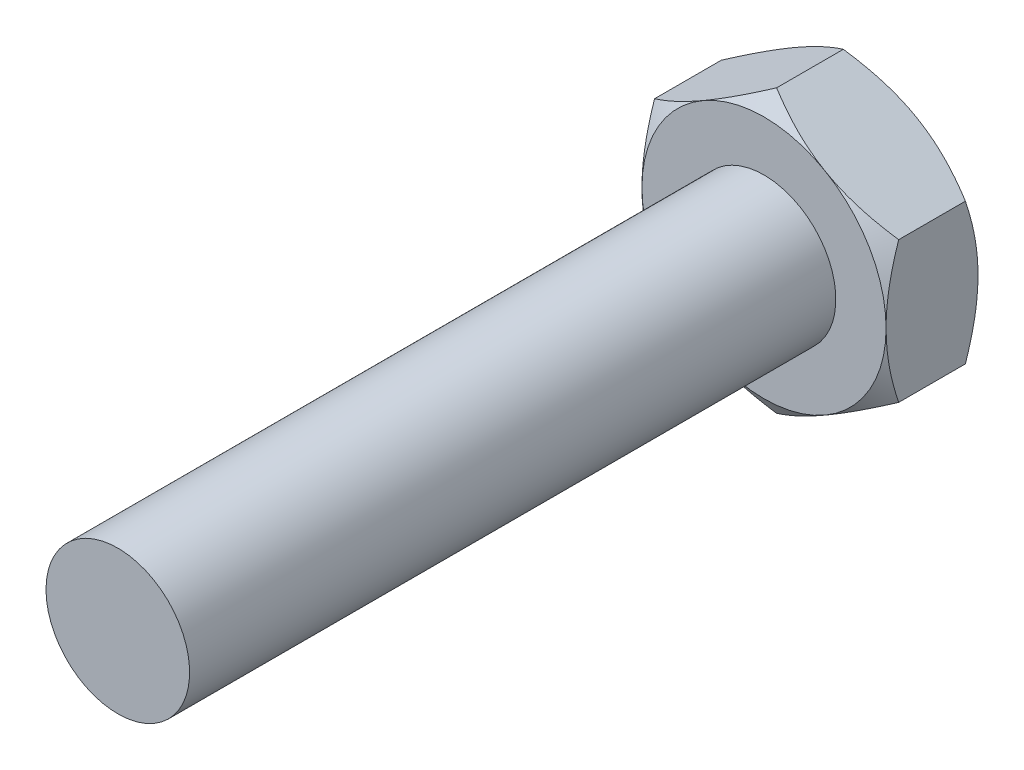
from build123d import *

# Parameters (mm, degrees)
AUFSATZ_LINEAR_AUSTRAGEN1_DEPTH = 6.4
SKIZZE2_R                       = 5
AUFSATZ_LINEAR_AUSTRAGEN2_DEPTH = 45


with BuildPart() as part:
    # Skizze1 → Aufsatz-Linear austragen1 (new body)
    with BuildSketch(Plane.XY):
        Polygon((8.5, 4.907477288), (0, 9.814954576), (-8.5, 4.907477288), (-8.5, -4.907477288), (0, -9.814954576), (8.5, -4.907477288), align=None)
    extrude(amount=AUFSATZ_LINEAR_AUSTRAGEN1_DEPTH)

    # Skizze2 → Aufsatz-Linear austragen2 (add)
    with BuildSketch(Plane.XY.offset(6.4)):
        with Locations(Location((0, 0, 0), (0, 0, 180))):
            Circle(SKIZZE2_R)
    extrude(amount=AUFSATZ_LINEAR_AUSTRAGEN2_DEPTH)

    # Skizze3 → Schnitt-Rotation1 (revolve, cut)
    with BuildSketch(Plane(origin=(0, 0, 0), x_dir=(1, 0, 0), z_dir=(0, 1, 0))):
        Polygon((-11.5, -2), (-8.5, 0), (-11.5, 0), align=None)
        Polygon((-11.5, -6.4), (-11.5, -4.4), (-8.5, -6.4), align=None)
    revolve(axis=Axis((0, 0, 0), (0, 0, 1)), mode=Mode.SUBTRACT)


solid = part.part
